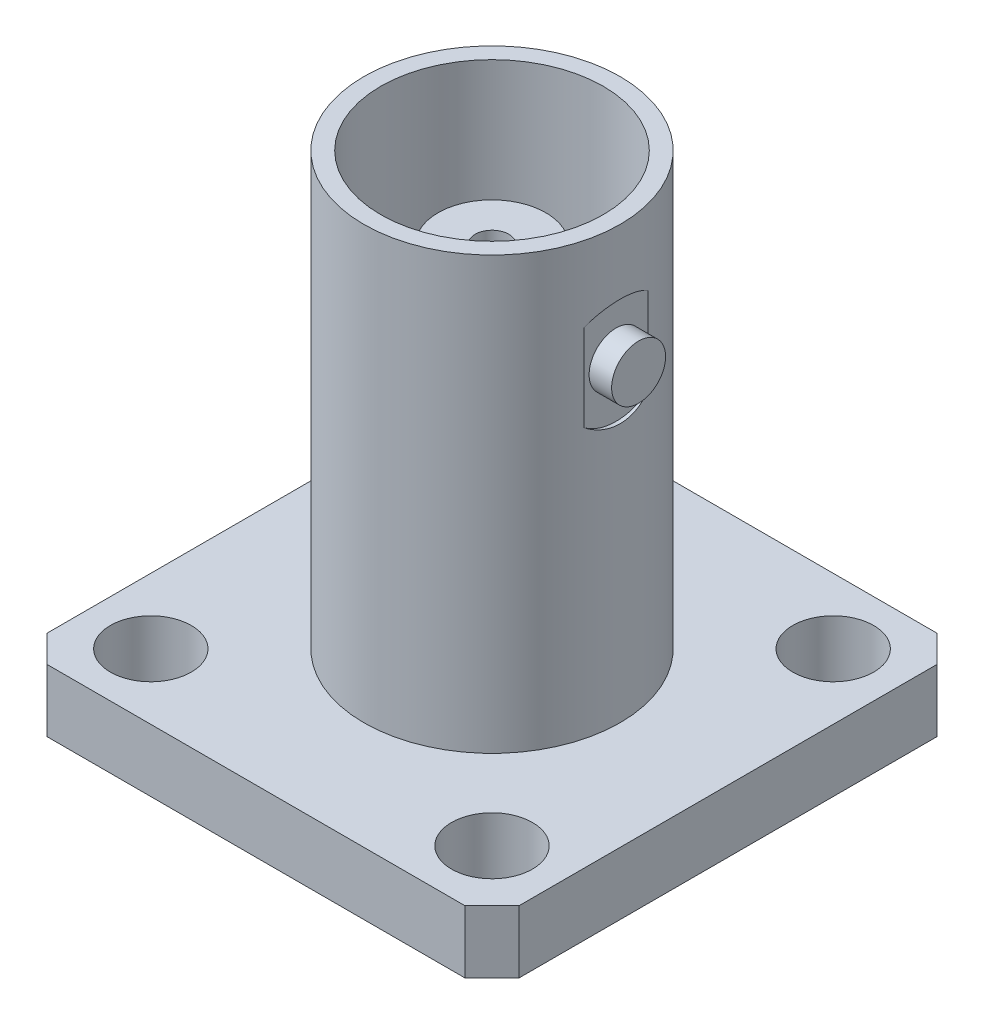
from build123d import *

# Parameters (mm, degrees)
SKETCH1_W               = 17.5
SKETCH1_H               = 17.5
BOSS_EXTRUDE1_DEPTH     = 2.32
CHAMFER2_SIZE           = 1
SKETCH2_R               = 1.5
CUT_EXTRUDE1_DEPTH      = 13.5899722
MIRROR2_COPY_1_SKETCH_R = 1.5
MIRROR2_COPY_1_DEPTH    = 13.5899722
SKETCH5_R               = 4.75
SKETCH5_R_2             = 4.125
BOSS_EXTRUDE2_DEPTH     = 16
SKETCH6_R               = 4.125
BOSS_EXTRUDE3_DEPTH     = 7.55
SKETCH7_R               = 2
BOSS_EXTRUDE4_DEPTH     = 5.45
SKETCH9_R               = 4.35
BOSS_EXTRUDE5_DEPTH     = 1.4
SKETCH12_R              = 2.675
BOSS_EXTRUDE8_DEPTH     = 1.45
SKETCH8_R               = 0.622706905
CUT_EXTRUDE2_DEPTH      = 22.983491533
SKETCH13_R              = 2
CUT_EXTRUDE3_DEPTH      = 0.15
SKETCH14_R              = 1
BOSS_EXTRUDE9_DEPTH     = 0.835


with BuildPart() as part:
    # Sketch1 → Boss-Extrude1 (new body)
    with BuildSketch(Plane(origin=(0, 0, 0), x_dir=(1, 0, 0), z_dir=(0, 1, 0))):
        Rectangle(SKETCH1_W, SKETCH1_H)
    extrude(amount=BOSS_EXTRUDE1_DEPTH)

    # Chamfer2
    chamfer2_edges = [part.edges().sort_by_distance(p)[0] for p in [
        (8.75, 1.16, 8.75),
        (-8.75, 1.16, 8.75),
        (-8.75, 1.16, -8.75),
        (8.75, 1.16, -8.75),
    ]]
    chamfer(chamfer2_edges, length=CHAMFER2_SIZE)

    # Sketch2 → Cut-Extrude1 (cut, through all)
    with BuildSketch(Plane(origin=(0, 2.32, 0), x_dir=(1, 0, 0), z_dir=(0, 1, 0))):
        with Locations(Location((6.325, 6.325, 0), (0, 0, 270))):
            Circle(SKETCH2_R)
    cut_extrude1 = extrude(amount=-CUT_EXTRUDE1_DEPTH, mode=Mode.SUBTRACT)

    # Mirror1: Cut-Extrude1 across plane
    add(cut_extrude1.mirror(Plane.XY), mode=Mode.SUBTRACT)

    # Mirror2: Cut-Extrude1 across plane
    add(cut_extrude1.mirror(Plane(origin=(0, 0, 0), x_dir=(0, 0, 1), z_dir=(1, 0, 0))), mode=Mode.SUBTRACT)

    # Mirror2 copy 1 sketch → Mirror2 copy 1 (cut, through all)
    with BuildSketch(Plane(origin=(0, 2.32, 0), x_dir=(-1, 0, 0), z_dir=(0, 1, 0))):
        with Locations(Location((6.325, 6.325, 0), (0, 0, 270))):
            Circle(MIRROR2_COPY_1_SKETCH_R)
    extrude(amount=-MIRROR2_COPY_1_DEPTH, mode=Mode.SUBTRACT)

    # Sketch5 → Boss-Extrude2 (add)
    with BuildSketch(Plane(origin=(0, 2.32, 0), x_dir=(1, 0, 0), z_dir=(0, 1, 0))):
        with Locations(Location((0, 0, 0), (0, 0, 270))):
            Circle(SKETCH5_R)
        with Locations(Location((0, 0, 0), (0, 0, 270))):
            Circle(SKETCH5_R_2, mode=Mode.SUBTRACT)
    extrude(amount=BOSS_EXTRUDE2_DEPTH)

    # Sketch6 → Boss-Extrude3 (add)
    with BuildSketch(Plane(origin=(0, 2.32, 0), x_dir=(1, 0, 0), z_dir=(0, 1, 0))):
        with Locations(Location((0, 0, 0), (0, 0, 270))):
            Circle(SKETCH6_R)
    extrude(amount=BOSS_EXTRUDE3_DEPTH)

    # Sketch7 → Boss-Extrude4 (add)
    with BuildSketch(Plane(origin=(0, 9.87, 0), x_dir=(1, 0, 0), z_dir=(0, 1, 0))):
        with Locations(Location((0, 0, 0), (0, 0, 270))):
            Circle(SKETCH7_R)
    extrude(amount=BOSS_EXTRUDE4_DEPTH)

    # Sketch9 → Boss-Extrude5 (add)
    with BuildSketch(Plane.XZ):
        with Locations(Location((0, 0, 0), (0, 0, 90))):
            Circle(SKETCH9_R)
    extrude(amount=BOSS_EXTRUDE5_DEPTH)

    # Sketch12 → Boss-Extrude8 (add)
    with BuildSketch(Plane.XZ.offset(1.4)):
        with Locations(Location((0, 0, 0), (0, 0, 270))):
            Circle(SKETCH12_R)
    extrude(amount=BOSS_EXTRUDE8_DEPTH)

    # Sketch8 → Cut-Extrude2 (cut, through all)
    with BuildSketch(Plane(origin=(0, 15.32, 0), x_dir=(1, 0, 0), z_dir=(0, 1, 0))):
        with Locations(Location((0, 0, 0), (0, 0, 270))):
            Circle(SKETCH8_R)
    extrude(amount=-CUT_EXTRUDE2_DEPTH, mode=Mode.SUBTRACT)

    # Sketch13 → Cut-Extrude3 (cut)
    with BuildSketch(Plane(origin=(4.75, 0, 0), x_dir=(0, 0, -1), z_dir=(1, 0, 0))):
        with Locations((0, 13.92)):
            Circle(SKETCH13_R)
    cut_extrude3 = extrude(amount=-CUT_EXTRUDE3_DEPTH, mode=Mode.SUBTRACT)

    # Sketch14 → Boss-Extrude9 (add)
    with BuildSketch(Plane(origin=(4.6, 0, 0), x_dir=(0, 0, -1), z_dir=(1, 0, 0))):
        with Locations((0, 13.92)):
            Circle(SKETCH14_R)
    boss_extrude9 = extrude(amount=BOSS_EXTRUDE9_DEPTH)

    # Mirror3: Cut-Extrude3, Boss-Extrude9 across plane
    add(cut_extrude3.mirror(Plane(origin=(0, 0, 0), x_dir=(0, 0, 1), z_dir=(1, 0, 0))), mode=Mode.SUBTRACT)
    add(boss_extrude9.mirror(Plane(origin=(0, 0, 0), x_dir=(0, 0, 1), z_dir=(1, 0, 0))))


solid = part.part
